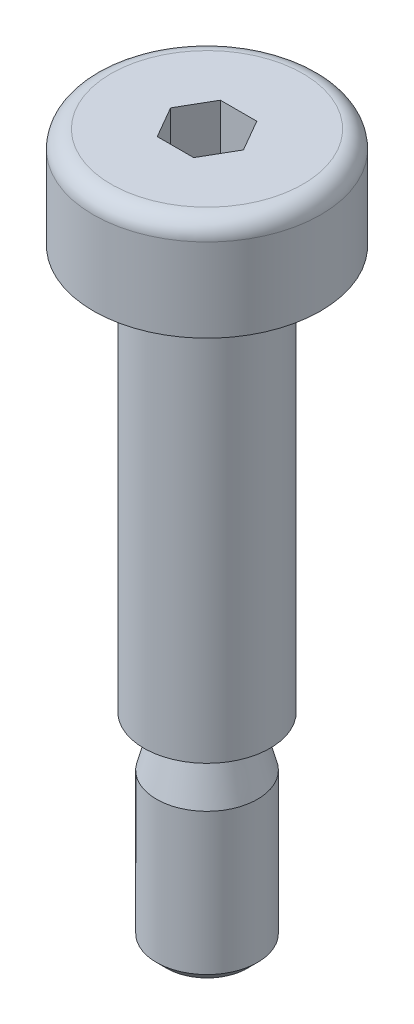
ISO-10303-21;
HEADER;
FILE_DESCRIPTION(('STEP AP214'),'2;1');
FILE_NAME('part.step','',(''),(''),'','','');
FILE_SCHEMA(('AUTOMOTIVE_DESIGN { 1 0 10303 214 1 1 1 1 }'));
ENDSEC;
DATA;
#1=APPLICATION_CONTEXT('core data for automotive mechanical design processes');
#2=APPLICATION_PROTOCOL_DEFINITION('international standard','automotive_design',2000,#1);
#3=PRODUCT_CONTEXT('',#1,'mechanical');
#4=PRODUCT('Part','Part','',(#3));
#5=PRODUCT_RELATED_PRODUCT_CATEGORY('part','',(#4));
#6=PRODUCT_DEFINITION_FORMATION('','',#4);
#7=PRODUCT_DEFINITION_CONTEXT('part definition',#1,'design');
#8=PRODUCT_DEFINITION('design','',#6,#7);
#9=PRODUCT_DEFINITION_SHAPE('','',#8);
#10=(LENGTH_UNIT() NAMED_UNIT(*) SI_UNIT(.MILLI.,.METRE.));
#11=(NAMED_UNIT(*) PLANE_ANGLE_UNIT() SI_UNIT($,.RADIAN.));
#12=(NAMED_UNIT(*) SI_UNIT($,.STERADIAN.) SOLID_ANGLE_UNIT());
#13=UNCERTAINTY_MEASURE_WITH_UNIT(LENGTH_MEASURE(1.E-05),#10,'distance_accuracy_value','');
#14=(GEOMETRIC_REPRESENTATION_CONTEXT(3) GLOBAL_UNCERTAINTY_ASSIGNED_CONTEXT((#13)) GLOBAL_UNIT_ASSIGNED_CONTEXT((#10,
#11,#12)) REPRESENTATION_CONTEXT('',''));
#15=CARTESIAN_POINT('',(0.,0.,0.));
#16=DIRECTION('',(0.,0.,1.));
#17=DIRECTION('',(1.,0.,0.));
#18=AXIS2_PLACEMENT_3D('',#15,#16,#17);
#19=CARTESIAN_POINT('',(0.,0.,0.));
#20=DIRECTION('',(0.,-1.,0.));
#21=DIRECTION('',(1.,0.,0.));
#22=AXIS2_PLACEMENT_3D('',#19,#20,#21);
#23=PLANE('',#22);
#24=CARTESIAN_POINT('',(0.,0.,0.));
#25=DIRECTION('',(0.,1.,0.));
#26=DIRECTION('',(-1.,0.,0.));
#27=AXIS2_PLACEMENT_3D('',#24,#25,#26);
#28=CIRCLE('',#27,1.6);
#29=CARTESIAN_POINT('',(-1.6,0.,0.));
#30=VERTEX_POINT('',#29);
#31=EDGE_CURVE('E11',#30,#30,#28,.T.);
#32=ORIENTED_EDGE('',*,*,#31,.F.);
#33=EDGE_LOOP('',(#32));
#34=FACE_BOUND('',#33,.T.);
#35=ADVANCED_FACE('F40',(#34),#23,.T.);
#36=CARTESIAN_POINT('',(0.,0.399999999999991,0.));
#37=DIRECTION('',(0.,1.,0.));
#38=DIRECTION('',(-1.,0.,0.));
#39=AXIS2_PLACEMENT_3D('',#36,#37,#38);
#40=CONICAL_SURFACE('',#39,1.99999999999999,0.785398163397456);
#41=ORIENTED_EDGE('',*,*,#31,.T.);
#42=EDGE_LOOP('',(#41));
#43=FACE_BOUND('',#42,.T.);
#44=CARTESIAN_POINT('',(0.,0.399999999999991,0.));
#45=DIRECTION('',(0.,1.,0.));
#46=DIRECTION('',(-1.,0.,0.));
#47=AXIS2_PLACEMENT_3D('',#44,#45,#46);
#48=CIRCLE('',#47,1.99999999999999);
#49=CARTESIAN_POINT('',(-1.99999999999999,0.399999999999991,0.));
#50=VERTEX_POINT('',#49);
#51=EDGE_CURVE('E47',#50,#50,#48,.T.);
#52=ORIENTED_EDGE('',*,*,#51,.F.);
#53=EDGE_LOOP('',(#52));
#54=FACE_BOUND('',#53,.T.);
#55=ADVANCED_FACE('F179',(#43,#54),#40,.T.);
#56=CARTESIAN_POINT('',(0.,28.,0.));
#57=DIRECTION('',(0.,1.,0.));
#58=DIRECTION('',(-1.,0.,0.));
#59=AXIS2_PLACEMENT_3D('',#56,#57,#58);
#60=CYLINDRICAL_SURFACE('',#59,2.);
#61=ORIENTED_EDGE('',*,*,#51,.T.);
#62=EDGE_LOOP('',(#61));
#63=FACE_BOUND('',#62,.T.);
#64=CARTESIAN_POINT('',(0.,6.,0.));
#65=DIRECTION('',(0.,1.,0.));
#66=DIRECTION('',(-1.,0.,0.));
#67=AXIS2_PLACEMENT_3D('',#64,#65,#66);
#68=CIRCLE('',#67,2.);
#69=CARTESIAN_POINT('',(-2.,6.,0.));
#70=VERTEX_POINT('',#69);
#71=EDGE_CURVE('E171',#70,#70,#68,.T.);
#72=ORIENTED_EDGE('',*,*,#71,.F.);
#73=EDGE_LOOP('',(#72));
#74=FACE_BOUND('',#73,.T.);
#75=ADVANCED_FACE('F176',(#63,#74),#60,.T.);
#76=CARTESIAN_POINT('',(0.,7.49282032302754,0.));
#77=DIRECTION('',(0.,-1.,0.));
#78=DIRECTION('',(1.,0.,0.));
#79=AXIS2_PLACEMENT_3D('',#76,#77,#78);
#80=CONICAL_SURFACE('',#79,1.6,0.26179938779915);
#81=ORIENTED_EDGE('',*,*,#71,.T.);
#82=EDGE_LOOP('',(#81));
#83=FACE_BOUND('',#82,.T.);
#84=CARTESIAN_POINT('',(0.,7.49282032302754,0.));
#85=DIRECTION('',(0.,1.,0.));
#86=DIRECTION('',(-1.,0.,0.));
#87=AXIS2_PLACEMENT_3D('',#84,#85,#86);
#88=CIRCLE('',#87,1.6);
#89=CARTESIAN_POINT('',(-1.6,7.49282032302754,0.));
#90=VERTEX_POINT('',#89);
#91=EDGE_CURVE('E168',#90,#90,#88,.T.);
#92=ORIENTED_EDGE('',*,*,#91,.F.);
#93=EDGE_LOOP('',(#92));
#94=FACE_BOUND('',#93,.T.);
#95=ADVANCED_FACE('F186',(#83,#94),#80,.T.);
#96=CARTESIAN_POINT('',(0.,28.,0.));
#97=DIRECTION('',(0.,1.,0.));
#98=DIRECTION('',(-1.,0.,0.));
#99=AXIS2_PLACEMENT_3D('',#96,#97,#98);
#100=CYLINDRICAL_SURFACE('',#99,1.6);
#101=ORIENTED_EDGE('',*,*,#91,.T.);
#102=EDGE_LOOP('',(#101));
#103=FACE_BOUND('',#102,.T.);
#104=CARTESIAN_POINT('',(0.,8.,0.));
#105=DIRECTION('',(0.,1.,0.));
#106=DIRECTION('',(-1.,0.,0.));
#107=AXIS2_PLACEMENT_3D('',#104,#105,#106);
#108=CIRCLE('',#107,1.6);
#109=CARTESIAN_POINT('',(-1.6,8.,0.));
#110=VERTEX_POINT('',#109);
#111=EDGE_CURVE('E165',#110,#110,#108,.T.);
#112=ORIENTED_EDGE('',*,*,#111,.F.);
#113=EDGE_LOOP('',(#112));
#114=FACE_BOUND('',#113,.T.);
#115=ADVANCED_FACE('F192',(#103,#114),#100,.T.);
#116=CARTESIAN_POINT('',(-1.6,8.,0.));
#117=DIRECTION('',(0.,-1.,0.));
#118=DIRECTION('',(1.,0.,0.));
#119=AXIS2_PLACEMENT_3D('',#116,#117,#118);
#120=PLANE('',#119);
#121=ORIENTED_EDGE('',*,*,#111,.T.);
#122=EDGE_LOOP('',(#121));
#123=FACE_BOUND('',#122,.T.);
#124=CARTESIAN_POINT('',(0.,8.,0.));
#125=DIRECTION('',(0.,1.,0.));
#126=DIRECTION('',(-1.,0.,0.));
#127=AXIS2_PLACEMENT_3D('',#124,#125,#126);
#128=CIRCLE('',#127,2.5);
#129=CARTESIAN_POINT('',(-2.5,8.,0.));
#130=VERTEX_POINT('',#129);
#131=EDGE_CURVE('E162',#130,#130,#128,.T.);
#132=ORIENTED_EDGE('',*,*,#131,.F.);
#133=EDGE_LOOP('',(#132));
#134=FACE_BOUND('',#133,.T.);
#135=ADVANCED_FACE('F196',(#123,#134),#120,.T.);
#136=CARTESIAN_POINT('',(0.,28.,0.));
#137=DIRECTION('',(0.,1.,0.));
#138=DIRECTION('',(-1.,0.,0.));
#139=AXIS2_PLACEMENT_3D('',#136,#137,#138);
#140=CYLINDRICAL_SURFACE('',#139,2.5);
#141=ORIENTED_EDGE('',*,*,#131,.T.);
#142=EDGE_LOOP('',(#141));
#143=FACE_BOUND('',#142,.T.);
#144=CARTESIAN_POINT('',(0.,24.,0.));
#145=DIRECTION('',(0.,1.,0.));
#146=DIRECTION('',(-1.,0.,0.));
#147=AXIS2_PLACEMENT_3D('',#144,#145,#146);
#148=CIRCLE('',#147,2.49999999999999);
#149=CARTESIAN_POINT('',(-2.5,24.,0.));
#150=VERTEX_POINT('',#149);
#151=EDGE_CURVE('E158',#150,#150,#148,.T.);
#152=ORIENTED_EDGE('',*,*,#151,.F.);
#153=EDGE_LOOP('',(#152));
#154=FACE_BOUND('',#153,.T.);
#155=ADVANCED_FACE('F200',(#143,#154),#140,.T.);
#156=CARTESIAN_POINT('',(-2.5,24.,0.));
#157=DIRECTION('',(0.,-1.,0.));
#158=DIRECTION('',(1.,0.,0.));
#159=AXIS2_PLACEMENT_3D('',#156,#157,#158);
#160=PLANE('',#159);
#161=ORIENTED_EDGE('',*,*,#151,.T.);
#162=EDGE_LOOP('',(#161));
#163=FACE_BOUND('',#162,.T.);
#164=CARTESIAN_POINT('',(0.,24.,0.));
#165=DIRECTION('',(0.,1.,0.));
#166=DIRECTION('',(-1.,0.,0.));
#167=AXIS2_PLACEMENT_3D('',#164,#165,#166);
#168=CIRCLE('',#167,4.5);
#169=CARTESIAN_POINT('',(-4.5,24.,0.));
#170=VERTEX_POINT('',#169);
#171=EDGE_CURVE('E154',#170,#170,#168,.T.);
#172=ORIENTED_EDGE('',*,*,#171,.F.);
#173=EDGE_LOOP('',(#172));
#174=FACE_BOUND('',#173,.T.);
#175=ADVANCED_FACE('F204',(#163,#174),#160,.T.);
#176=CARTESIAN_POINT('',(0.,28.,0.));
#177=DIRECTION('',(0.,1.,0.));
#178=DIRECTION('',(-1.,0.,0.));
#179=AXIS2_PLACEMENT_3D('',#176,#177,#178);
#180=CYLINDRICAL_SURFACE('',#179,4.5);
#181=ORIENTED_EDGE('',*,*,#171,.T.);
#182=EDGE_LOOP('',(#181));
#183=FACE_BOUND('',#182,.T.);
#184=CARTESIAN_POINT('',(0.,27.3,0.));
#185=DIRECTION('',(0.,1.,0.));
#186=DIRECTION('',(-1.,0.,0.));
#187=AXIS2_PLACEMENT_3D('',#184,#185,#186);
#188=CIRCLE('',#187,4.5);
#189=CARTESIAN_POINT('',(-4.5,27.3,0.));
#190=VERTEX_POINT('',#189);
#191=EDGE_CURVE('E150',#190,#190,#188,.T.);
#192=ORIENTED_EDGE('',*,*,#191,.F.);
#193=EDGE_LOOP('',(#192));
#194=FACE_BOUND('',#193,.T.);
#195=ADVANCED_FACE('F208',(#183,#194),#180,.T.);
#196=CARTESIAN_POINT('',(0.,27.3,0.));
#197=DIRECTION('',(0.,1.,0.));
#198=DIRECTION('',(-1.,0.,0.));
#199=AXIS2_PLACEMENT_3D('',#196,#197,#198);
#200=TOROIDAL_SURFACE('',#199,3.8,0.700000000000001);
#201=ORIENTED_EDGE('',*,*,#191,.T.);
#202=EDGE_LOOP('',(#201));
#203=FACE_BOUND('',#202,.T.);
#204=CARTESIAN_POINT('',(0.,28.,0.));
#205=DIRECTION('',(0.,1.,0.));
#206=DIRECTION('',(-1.,0.,0.));
#207=AXIS2_PLACEMENT_3D('',#204,#205,#206);
#208=CIRCLE('',#207,3.8);
#209=CARTESIAN_POINT('',(-3.8,28.,0.));
#210=VERTEX_POINT('',#209);
#211=EDGE_CURVE('E141',#210,#210,#208,.T.);
#212=ORIENTED_EDGE('',*,*,#211,.F.);
#213=EDGE_LOOP('',(#212));
#214=FACE_BOUND('',#213,.T.);
#215=ADVANCED_FACE('F212',(#203,#214),#200,.T.);
#216=CARTESIAN_POINT('',(-3.8,28.,0.));
#217=DIRECTION('',(0.,1.,0.));
#218=DIRECTION('',(-1.,0.,0.));
#219=AXIS2_PLACEMENT_3D('',#216,#217,#218);
#220=PLANE('',#219);
#221=DIRECTION('',(-0.5,0.,-0.866025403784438));
#222=VECTOR('',#221,1.);
#223=CARTESIAN_POINT('',(1.44337567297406,28.,0.));
#224=LINE('',#223,#222);
#225=CARTESIAN_POINT('',(1.44337567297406,28.,0.));
#226=VERTEX_POINT('',#225);
#227=CARTESIAN_POINT('',(0.721687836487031,28.,-1.25));
#228=VERTEX_POINT('',#227);
#229=EDGE_CURVE('E54',#226,#228,#224,.T.);
#230=ORIENTED_EDGE('',*,*,#229,.F.);
#231=DIRECTION('',(0.5,0.,-0.866025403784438));
#232=VECTOR('',#231,1.);
#233=CARTESIAN_POINT('',(0.72168783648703,28.,1.25));
#234=LINE('',#233,#232);
#235=CARTESIAN_POINT('',(0.72168783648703,28.,1.25));
#236=VERTEX_POINT('',#235);
#237=EDGE_CURVE('E137',#236,#226,#234,.T.);
#238=ORIENTED_EDGE('',*,*,#237,.F.);
#239=DIRECTION('',(1.,0.,0.));
#240=VECTOR('',#239,1.);
#241=CARTESIAN_POINT('',(-0.721687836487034,28.,1.25));
#242=LINE('',#241,#240);
#243=CARTESIAN_POINT('',(-0.721687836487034,28.,1.25));
#244=VERTEX_POINT('',#243);
#245=EDGE_CURVE('E135',#244,#236,#242,.T.);
#246=ORIENTED_EDGE('',*,*,#245,.F.);
#247=DIRECTION('',(0.5,0.,0.866025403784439));
#248=VECTOR('',#247,1.);
#249=CARTESIAN_POINT('',(-1.44337567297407,28.,0.));
#250=LINE('',#249,#248);
#251=CARTESIAN_POINT('',(-1.44337567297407,28.,0.));
#252=VERTEX_POINT('',#251);
#253=EDGE_CURVE('E102',#252,#244,#250,.T.);
#254=ORIENTED_EDGE('',*,*,#253,.F.);
#255=DIRECTION('',(-0.5,0.,0.866025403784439));
#256=VECTOR('',#255,1.);
#257=CARTESIAN_POINT('',(-0.721687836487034,28.,-1.25));
#258=LINE('',#257,#256);
#259=CARTESIAN_POINT('',(-0.721687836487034,28.,-1.25));
#260=VERTEX_POINT('',#259);
#261=EDGE_CURVE('E131',#260,#252,#258,.T.);
#262=ORIENTED_EDGE('',*,*,#261,.F.);
#263=DIRECTION('',(-1.,0.,0.));
#264=VECTOR('',#263,1.);
#265=CARTESIAN_POINT('',(0.72168783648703,28.,-1.25));
#266=LINE('',#265,#264);
#267=EDGE_CURVE('E128',#228,#260,#266,.T.);
#268=ORIENTED_EDGE('',*,*,#267,.F.);
#269=EDGE_LOOP('',(#230,#238,#246,#254,#262,#268));
#270=FACE_BOUND('',#269,.T.);
#271=ORIENTED_EDGE('',*,*,#211,.T.);
#272=EDGE_LOOP('',(#271));
#273=FACE_BOUND('',#272,.T.);
#274=ADVANCED_FACE('F216',(#270,#273),#220,.T.);
#275=CARTESIAN_POINT('',(1.44337567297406,26.,0.));
#276=DIRECTION('',(0.866025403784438,0.,-0.5));
#277=DIRECTION('',(-0.5,0.,-0.866025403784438));
#278=AXIS2_PLACEMENT_3D('',#275,#276,#277);
#279=PLANE('',#278);
#280=ORIENTED_EDGE('',*,*,#229,.T.);
#281=DIRECTION('',(0.,1.,0.));
#282=VECTOR('',#281,1.);
#283=CARTESIAN_POINT('',(0.72168783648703,26.,-1.25));
#284=LINE('',#283,#282);
#285=CARTESIAN_POINT('',(0.72168783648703,26.,-1.25));
#286=VERTEX_POINT('',#285);
#287=EDGE_CURVE('E84',#286,#228,#284,.T.);
#288=ORIENTED_EDGE('',*,*,#287,.F.);
#289=DIRECTION('',(-0.5,0.,-0.866025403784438));
#290=VECTOR('',#289,1.);
#291=CARTESIAN_POINT('',(1.44337567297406,26.,0.));
#292=LINE('',#291,#290);
#293=CARTESIAN_POINT('',(1.44337567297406,26.,0.));
#294=VERTEX_POINT('',#293);
#295=EDGE_CURVE('E139',#294,#286,#292,.T.);
#296=ORIENTED_EDGE('',*,*,#295,.F.);
#297=DIRECTION('',(0.,1.,0.));
#298=VECTOR('',#297,1.);
#299=CARTESIAN_POINT('',(1.44337567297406,26.,0.));
#300=LINE('',#299,#298);
#301=EDGE_CURVE('E62',#294,#226,#300,.T.);
#302=ORIENTED_EDGE('',*,*,#301,.T.);
#303=EDGE_LOOP('',(#280,#288,#296,#302));
#304=FACE_BOUND('',#303,.T.);
#305=ADVANCED_FACE('F220',(#304),#279,.F.);
#306=CARTESIAN_POINT('',(0.72168783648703,26.,1.25));
#307=DIRECTION('',(0.866025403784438,0.,0.5));
#308=DIRECTION('',(0.5,0.,-0.866025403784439));
#309=AXIS2_PLACEMENT_3D('',#306,#307,#308);
#310=PLANE('',#309);
#311=ORIENTED_EDGE('',*,*,#237,.T.);
#312=ORIENTED_EDGE('',*,*,#301,.F.);
#313=DIRECTION('',(0.5,0.,-0.866025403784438));
#314=VECTOR('',#313,1.);
#315=CARTESIAN_POINT('',(0.72168783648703,26.,1.25));
#316=LINE('',#315,#314);
#317=CARTESIAN_POINT('',(0.72168783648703,26.,1.25));
#318=VERTEX_POINT('',#317);
#319=EDGE_CURVE('E114',#318,#294,#316,.T.);
#320=ORIENTED_EDGE('',*,*,#319,.F.);
#321=DIRECTION('',(0.,1.,0.));
#322=VECTOR('',#321,1.);
#323=CARTESIAN_POINT('',(0.72168783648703,26.,1.25));
#324=LINE('',#323,#322);
#325=EDGE_CURVE('E106',#318,#236,#324,.T.);
#326=ORIENTED_EDGE('',*,*,#325,.T.);
#327=EDGE_LOOP('',(#311,#312,#320,#326));
#328=FACE_BOUND('',#327,.T.);
#329=ADVANCED_FACE('F224',(#328),#310,.F.);
#330=CARTESIAN_POINT('',(-0.721687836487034,26.,1.25));
#331=DIRECTION('',(0.,0.,1.));
#332=DIRECTION('',(1.,0.,0.));
#333=AXIS2_PLACEMENT_3D('',#330,#331,#332);
#334=PLANE('',#333);
#335=ORIENTED_EDGE('',*,*,#245,.T.);
#336=ORIENTED_EDGE('',*,*,#325,.F.);
#337=DIRECTION('',(1.,0.,0.));
#338=VECTOR('',#337,1.);
#339=CARTESIAN_POINT('',(-0.721687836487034,26.,1.25));
#340=LINE('',#339,#338);
#341=CARTESIAN_POINT('',(-0.721687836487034,26.,1.25));
#342=VERTEX_POINT('',#341);
#343=EDGE_CURVE('E110',#342,#318,#340,.T.);
#344=ORIENTED_EDGE('',*,*,#343,.F.);
#345=DIRECTION('',(0.,1.,0.));
#346=VECTOR('',#345,1.);
#347=CARTESIAN_POINT('',(-0.721687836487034,26.,1.25));
#348=LINE('',#347,#346);
#349=EDGE_CURVE('E95',#342,#244,#348,.T.);
#350=ORIENTED_EDGE('',*,*,#349,.T.);
#351=EDGE_LOOP('',(#335,#336,#344,#350));
#352=FACE_BOUND('',#351,.T.);
#353=ADVANCED_FACE('F111',(#352),#334,.F.);
#354=CARTESIAN_POINT('',(-1.44337567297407,26.,0.));
#355=DIRECTION('',(-0.866025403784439,0.,0.5));
#356=DIRECTION('',(0.5,0.,0.866025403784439));
#357=AXIS2_PLACEMENT_3D('',#354,#355,#356);
#358=PLANE('',#357);
#359=ORIENTED_EDGE('',*,*,#253,.T.);
#360=ORIENTED_EDGE('',*,*,#349,.F.);
#361=DIRECTION('',(0.5,0.,0.866025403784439));
#362=VECTOR('',#361,1.);
#363=CARTESIAN_POINT('',(-1.44337567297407,26.,0.));
#364=LINE('',#363,#362);
#365=CARTESIAN_POINT('',(-1.44337567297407,26.,0.));
#366=VERTEX_POINT('',#365);
#367=EDGE_CURVE('E99',#366,#342,#364,.T.);
#368=ORIENTED_EDGE('',*,*,#367,.F.);
#369=DIRECTION('',(0.,1.,0.));
#370=VECTOR('',#369,1.);
#371=CARTESIAN_POINT('',(-1.44337567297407,26.,0.));
#372=LINE('',#371,#370);
#373=EDGE_CURVE('E107',#366,#252,#372,.T.);
#374=ORIENTED_EDGE('',*,*,#373,.T.);
#375=EDGE_LOOP('',(#359,#360,#368,#374));
#376=FACE_BOUND('',#375,.T.);
#377=ADVANCED_FACE('F97',(#376),#358,.F.);
#378=CARTESIAN_POINT('',(-0.721687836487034,26.,-1.25));
#379=DIRECTION('',(-0.866025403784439,0.,-0.5));
#380=DIRECTION('',(-0.5,0.,0.866025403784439));
#381=AXIS2_PLACEMENT_3D('',#378,#379,#380);
#382=PLANE('',#381);
#383=ORIENTED_EDGE('',*,*,#261,.T.);
#384=ORIENTED_EDGE('',*,*,#373,.F.);
#385=DIRECTION('',(-0.5,0.,0.866025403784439));
#386=VECTOR('',#385,1.);
#387=CARTESIAN_POINT('',(-0.721687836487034,26.,-1.25));
#388=LINE('',#387,#386);
#389=CARTESIAN_POINT('',(-0.721687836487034,26.,-1.25));
#390=VERTEX_POINT('',#389);
#391=EDGE_CURVE('E120',#390,#366,#388,.T.);
#392=ORIENTED_EDGE('',*,*,#391,.F.);
#393=DIRECTION('',(0.,1.,0.));
#394=VECTOR('',#393,1.);
#395=CARTESIAN_POINT('',(-0.721687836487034,26.,-1.25));
#396=LINE('',#395,#394);
#397=EDGE_CURVE('E144',#390,#260,#396,.T.);
#398=ORIENTED_EDGE('',*,*,#397,.T.);
#399=EDGE_LOOP('',(#383,#384,#392,#398));
#400=FACE_BOUND('',#399,.T.);
#401=ADVANCED_FACE('F228',(#400),#382,.F.);
#402=CARTESIAN_POINT('',(0.72168783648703,26.,-1.25));
#403=DIRECTION('',(0.,0.,-1.));
#404=DIRECTION('',(-1.,0.,0.));
#405=AXIS2_PLACEMENT_3D('',#402,#403,#404);
#406=PLANE('',#405);
#407=ORIENTED_EDGE('',*,*,#267,.T.);
#408=ORIENTED_EDGE('',*,*,#397,.F.);
#409=DIRECTION('',(-1.,0.,0.));
#410=VECTOR('',#409,1.);
#411=CARTESIAN_POINT('',(0.72168783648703,26.,-1.25));
#412=LINE('',#411,#410);
#413=EDGE_CURVE('E122',#286,#390,#412,.T.);
#414=ORIENTED_EDGE('',*,*,#413,.F.);
#415=ORIENTED_EDGE('',*,*,#287,.T.);
#416=EDGE_LOOP('',(#407,#408,#414,#415));
#417=FACE_BOUND('',#416,.T.);
#418=ADVANCED_FACE('F225',(#417),#406,.F.);
#419=CARTESIAN_POINT('',(0.,26.,0.));
#420=DIRECTION('',(0.,1.,0.));
#421=DIRECTION('',(0.,0.,1.));
#422=AXIS2_PLACEMENT_3D('',#419,#420,#421);
#423=PLANE('',#422);
#424=ORIENTED_EDGE('',*,*,#295,.T.);
#425=ORIENTED_EDGE('',*,*,#413,.T.);
#426=ORIENTED_EDGE('',*,*,#391,.T.);
#427=ORIENTED_EDGE('',*,*,#367,.T.);
#428=ORIENTED_EDGE('',*,*,#343,.T.);
#429=ORIENTED_EDGE('',*,*,#319,.T.);
#430=EDGE_LOOP('',(#424,#425,#426,#427,#428,#429));
#431=FACE_BOUND('',#430,.T.);
#432=ADVANCED_FACE('F117',(#431),#423,.T.);
#433=CLOSED_SHELL('',(#35,#55,#75,#95,#115,#135,#155,#175,#195,#215,#274,#305,#329,#353,#377,
#401,#418,#432));
#434=MANIFOLD_SOLID_BREP('B2',#433);
#435=ADVANCED_BREP_SHAPE_REPRESENTATION('',(#18,#434),#14);
#436=SHAPE_DEFINITION_REPRESENTATION(#9,#435);
ENDSEC;
END-ISO-10303-21;
